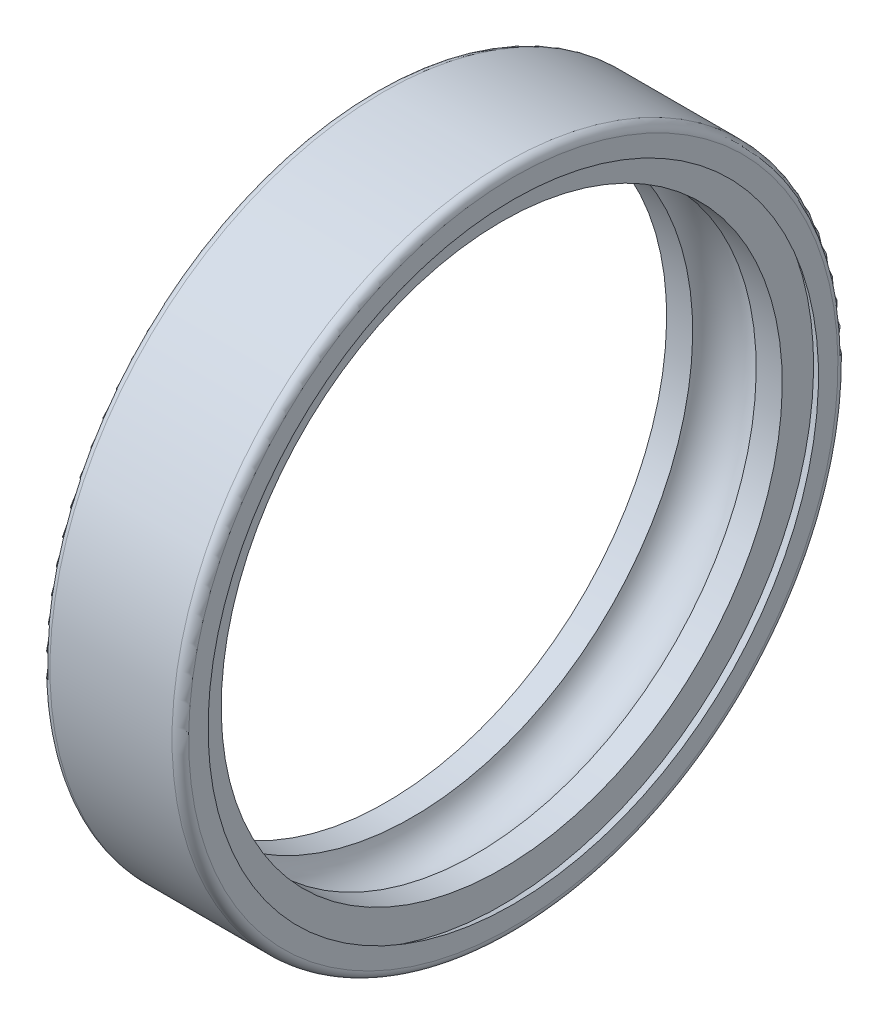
ISO-10303-21;
HEADER;
FILE_DESCRIPTION(('STEP AP214'),'2;1');
FILE_NAME('part.step','',(''),(''),'','','');
FILE_SCHEMA(('AUTOMOTIVE_DESIGN { 1 0 10303 214 1 1 1 1 }'));
ENDSEC;
DATA;
#1=APPLICATION_CONTEXT('core data for automotive mechanical design processes');
#2=APPLICATION_PROTOCOL_DEFINITION('international standard','automotive_design',2000,#1);
#3=PRODUCT_CONTEXT('',#1,'mechanical');
#4=PRODUCT('Part','Part','',(#3));
#5=PRODUCT_RELATED_PRODUCT_CATEGORY('part','',(#4));
#6=PRODUCT_DEFINITION_FORMATION('','',#4);
#7=PRODUCT_DEFINITION_CONTEXT('part definition',#1,'design');
#8=PRODUCT_DEFINITION('design','',#6,#7);
#9=PRODUCT_DEFINITION_SHAPE('','',#8);
#10=(LENGTH_UNIT() NAMED_UNIT(*) SI_UNIT(.MILLI.,.METRE.));
#11=(NAMED_UNIT(*) PLANE_ANGLE_UNIT() SI_UNIT($,.RADIAN.));
#12=(NAMED_UNIT(*) SI_UNIT($,.STERADIAN.) SOLID_ANGLE_UNIT());
#13=UNCERTAINTY_MEASURE_WITH_UNIT(LENGTH_MEASURE(1.E-05),#10,'distance_accuracy_value','');
#14=(GEOMETRIC_REPRESENTATION_CONTEXT(3) GLOBAL_UNCERTAINTY_ASSIGNED_CONTEXT((#13)) GLOBAL_UNIT_ASSIGNED_CONTEXT((#10,
#11,#12)) REPRESENTATION_CONTEXT('',''));
#15=CARTESIAN_POINT('',(0.,0.,0.));
#16=DIRECTION('',(0.,0.,1.));
#17=DIRECTION('',(1.,0.,0.));
#18=AXIS2_PLACEMENT_3D('',#15,#16,#17);
#19=CARTESIAN_POINT('',(4.58333333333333,10.6752813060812,0.));
#20=DIRECTION('',(1.,0.,0.));
#21=DIRECTION('',(0.,1.,0.));
#22=AXIS2_PLACEMENT_3D('',#19,#20,#21);
#23=PLANE('',#22);
#24=CARTESIAN_POINT('',(4.58333333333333,0.,0.));
#25=DIRECTION('',(1.,0.,0.));
#26=DIRECTION('',(0.,1.,0.));
#27=AXIS2_PLACEMENT_3D('',#24,#25,#26);
#28=CIRCLE('',#27,11.2405626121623);
#29=CARTESIAN_POINT('',(4.58333333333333,11.2405626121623,0.));
#30=VERTEX_POINT('',#29);
#31=EDGE_CURVE('E11',#30,#30,#28,.T.);
#32=ORIENTED_EDGE('',*,*,#31,.T.);
#33=EDGE_LOOP('',(#32));
#34=FACE_BOUND('',#33,.T.);
#35=CARTESIAN_POINT('',(4.58333333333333,0.,0.));
#36=DIRECTION('',(1.,0.,0.));
#37=DIRECTION('',(0.,1.,0.));
#38=AXIS2_PLACEMENT_3D('',#35,#36,#37);
#39=CIRCLE('',#38,10.11);
#40=CARTESIAN_POINT('',(4.58333333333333,10.11,0.));
#41=VERTEX_POINT('',#40);
#42=EDGE_CURVE('E73',#41,#41,#39,.T.);
#43=ORIENTED_EDGE('',*,*,#42,.F.);
#44=EDGE_LOOP('',(#43));
#45=FACE_BOUND('',#44,.T.);
#46=ADVANCED_FACE('F17',(#34,#45),#23,.T.);
#47=CARTESIAN_POINT('',(4.79166666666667,0.,0.));
#48=DIRECTION('',(-1.,0.,0.));
#49=DIRECTION('',(0.,1.,0.));
#50=AXIS2_PLACEMENT_3D('',#47,#48,#49);
#51=CONICAL_SURFACE('',#50,11.1202813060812,0.523598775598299);
#52=CARTESIAN_POINT('',(5.,0.,0.));
#53=DIRECTION('',(1.,0.,0.));
#54=DIRECTION('',(0.,1.,0.));
#55=AXIS2_PLACEMENT_3D('',#52,#53,#54);
#56=CIRCLE('',#55,11.);
#57=CARTESIAN_POINT('',(5.,11.,0.));
#58=VERTEX_POINT('',#57);
#59=EDGE_CURVE('E27',#58,#58,#56,.T.);
#60=ORIENTED_EDGE('',*,*,#59,.T.);
#61=EDGE_LOOP('',(#60));
#62=FACE_BOUND('',#61,.T.);
#63=ORIENTED_EDGE('',*,*,#31,.F.);
#64=EDGE_LOOP('',(#63));
#65=FACE_BOUND('',#64,.T.);
#66=ADVANCED_FACE('F106',(#62,#65),#51,.F.);
#67=CARTESIAN_POINT('',(5.,11.35,0.));
#68=DIRECTION('',(1.,0.,0.));
#69=DIRECTION('',(0.,1.,0.));
#70=AXIS2_PLACEMENT_3D('',#67,#68,#69);
#71=PLANE('',#70);
#72=CARTESIAN_POINT('',(5.,0.,0.));
#73=DIRECTION('',(1.,0.,0.));
#74=DIRECTION('',(0.,1.,0.));
#75=AXIS2_PLACEMENT_3D('',#72,#73,#74);
#76=CIRCLE('',#75,11.7);
#77=CARTESIAN_POINT('',(5.,11.7,0.));
#78=VERTEX_POINT('',#77);
#79=EDGE_CURVE('E83',#78,#78,#76,.T.);
#80=ORIENTED_EDGE('',*,*,#79,.T.);
#81=EDGE_LOOP('',(#80));
#82=FACE_BOUND('',#81,.T.);
#83=ORIENTED_EDGE('',*,*,#59,.F.);
#84=EDGE_LOOP('',(#83));
#85=FACE_BOUND('',#84,.T.);
#86=ADVANCED_FACE('F111',(#82,#85),#71,.T.);
#87=CARTESIAN_POINT('',(4.7,0.,0.));
#88=DIRECTION('',(1.,0.,0.));
#89=DIRECTION('',(0.,0.,-1.));
#90=AXIS2_PLACEMENT_3D('',#87,#88,#89);
#91=TOROIDAL_SURFACE('',#90,11.7,0.3);
#92=CARTESIAN_POINT('',(4.7,0.,0.));
#93=DIRECTION('',(1.,0.,0.));
#94=DIRECTION('',(0.,1.,0.));
#95=AXIS2_PLACEMENT_3D('',#92,#93,#94);
#96=CIRCLE('',#95,12.);
#97=CARTESIAN_POINT('',(4.7,12.,0.));
#98=VERTEX_POINT('',#97);
#99=EDGE_CURVE('E82',#98,#98,#96,.T.);
#100=ORIENTED_EDGE('',*,*,#99,.T.);
#101=EDGE_LOOP('',(#100));
#102=FACE_BOUND('',#101,.T.);
#103=ORIENTED_EDGE('',*,*,#79,.F.);
#104=EDGE_LOOP('',(#103));
#105=FACE_BOUND('',#104,.T.);
#106=ADVANCED_FACE('F102',(#102,#105),#91,.T.);
#107=CARTESIAN_POINT('',(2.5,0.,0.));
#108=DIRECTION('',(-1.,0.,0.));
#109=DIRECTION('',(0.,1.,0.));
#110=AXIS2_PLACEMENT_3D('',#107,#108,#109);
#111=CYLINDRICAL_SURFACE('',#110,12.);
#112=CARTESIAN_POINT('',(0.3,0.,0.));
#113=DIRECTION('',(1.,0.,0.));
#114=DIRECTION('',(0.,1.,0.));
#115=AXIS2_PLACEMENT_3D('',#112,#113,#114);
#116=CIRCLE('',#115,12.);
#117=CARTESIAN_POINT('',(0.3,12.,0.));
#118=VERTEX_POINT('',#117);
#119=EDGE_CURVE('E21',#118,#118,#116,.T.);
#120=ORIENTED_EDGE('',*,*,#119,.T.);
#121=EDGE_LOOP('',(#120));
#122=FACE_BOUND('',#121,.T.);
#123=ORIENTED_EDGE('',*,*,#99,.F.);
#124=EDGE_LOOP('',(#123));
#125=FACE_BOUND('',#124,.T.);
#126=ADVANCED_FACE('F88',(#122,#125),#111,.T.);
#127=CARTESIAN_POINT('',(0.3,0.,0.));
#128=DIRECTION('',(1.,0.,0.));
#129=DIRECTION('',(0.,0.,-1.));
#130=AXIS2_PLACEMENT_3D('',#127,#128,#129);
#131=TOROIDAL_SURFACE('',#130,11.7,0.3);
#132=CARTESIAN_POINT('',(0.,0.,0.));
#133=DIRECTION('',(1.,0.,0.));
#134=DIRECTION('',(0.,1.,0.));
#135=AXIS2_PLACEMENT_3D('',#132,#133,#134);
#136=CIRCLE('',#135,11.7);
#137=CARTESIAN_POINT('',(0.,11.7,0.));
#138=VERTEX_POINT('',#137);
#139=EDGE_CURVE('E80',#138,#138,#136,.T.);
#140=ORIENTED_EDGE('',*,*,#139,.T.);
#141=EDGE_LOOP('',(#140));
#142=FACE_BOUND('',#141,.T.);
#143=ORIENTED_EDGE('',*,*,#119,.F.);
#144=EDGE_LOOP('',(#143));
#145=FACE_BOUND('',#144,.T.);
#146=ADVANCED_FACE('F91',(#142,#145),#131,.T.);
#147=CARTESIAN_POINT('',(0.,11.35,0.));
#148=DIRECTION('',(-1.,0.,0.));
#149=DIRECTION('',(0.,-1.,0.));
#150=AXIS2_PLACEMENT_3D('',#147,#148,#149);
#151=PLANE('',#150);
#152=CARTESIAN_POINT('',(0.,0.,0.));
#153=DIRECTION('',(1.,0.,0.));
#154=DIRECTION('',(0.,1.,0.));
#155=AXIS2_PLACEMENT_3D('',#152,#153,#154);
#156=CIRCLE('',#155,11.);
#157=CARTESIAN_POINT('',(0.,11.,0.));
#158=VERTEX_POINT('',#157);
#159=EDGE_CURVE('E71',#158,#158,#156,.T.);
#160=ORIENTED_EDGE('',*,*,#159,.T.);
#161=EDGE_LOOP('',(#160));
#162=FACE_BOUND('',#161,.T.);
#163=ORIENTED_EDGE('',*,*,#139,.F.);
#164=EDGE_LOOP('',(#163));
#165=FACE_BOUND('',#164,.T.);
#166=ADVANCED_FACE('F93',(#162,#165),#151,.T.);
#167=CARTESIAN_POINT('',(0.208333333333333,0.,0.));
#168=DIRECTION('',(1.,0.,0.));
#169=DIRECTION('',(0.,1.,0.));
#170=AXIS2_PLACEMENT_3D('',#167,#168,#169);
#171=CONICAL_SURFACE('',#170,11.1202813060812,0.523598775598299);
#172=CARTESIAN_POINT('',(0.416666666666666,0.,0.));
#173=DIRECTION('',(1.,0.,0.));
#174=DIRECTION('',(0.,1.,0.));
#175=AXIS2_PLACEMENT_3D('',#172,#173,#174);
#176=CIRCLE('',#175,11.2405626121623);
#177=CARTESIAN_POINT('',(0.416666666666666,11.2405626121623,0.));
#178=VERTEX_POINT('',#177);
#179=EDGE_CURVE('E68',#178,#178,#176,.T.);
#180=ORIENTED_EDGE('',*,*,#179,.T.);
#181=EDGE_LOOP('',(#180));
#182=FACE_BOUND('',#181,.T.);
#183=ORIENTED_EDGE('',*,*,#159,.F.);
#184=EDGE_LOOP('',(#183));
#185=FACE_BOUND('',#184,.T.);
#186=ADVANCED_FACE('F19',(#182,#185),#171,.F.);
#187=CARTESIAN_POINT('',(0.416666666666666,10.6752813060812,0.));
#188=DIRECTION('',(-1.,0.,0.));
#189=DIRECTION('',(0.,-1.,0.));
#190=AXIS2_PLACEMENT_3D('',#187,#188,#189);
#191=PLANE('',#190);
#192=CARTESIAN_POINT('',(0.416666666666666,0.,0.));
#193=DIRECTION('',(1.,0.,0.));
#194=DIRECTION('',(0.,1.,0.));
#195=AXIS2_PLACEMENT_3D('',#192,#193,#194);
#196=CIRCLE('',#195,10.11);
#197=CARTESIAN_POINT('',(0.416666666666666,10.11,0.));
#198=VERTEX_POINT('',#197);
#199=EDGE_CURVE('E64',#198,#198,#196,.T.);
#200=ORIENTED_EDGE('',*,*,#199,.T.);
#201=EDGE_LOOP('',(#200));
#202=FACE_BOUND('',#201,.T.);
#203=ORIENTED_EDGE('',*,*,#179,.F.);
#204=EDGE_LOOP('',(#203));
#205=FACE_BOUND('',#204,.T.);
#206=ADVANCED_FACE('F65',(#202,#205),#191,.T.);
#207=CARTESIAN_POINT('',(0.885969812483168,0.,0.));
#208=DIRECTION('',(-1.,0.,0.));
#209=DIRECTION('',(0.,1.,0.));
#210=AXIS2_PLACEMENT_3D('',#207,#208,#209);
#211=CYLINDRICAL_SURFACE('',#210,10.11);
#212=CARTESIAN_POINT('',(1.35527295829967,0.,0.));
#213=DIRECTION('',(1.,0.,0.));
#214=DIRECTION('',(0.,1.,0.));
#215=AXIS2_PLACEMENT_3D('',#212,#213,#214);
#216=CIRCLE('',#215,10.11);
#217=CARTESIAN_POINT('',(1.35527295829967,10.11,0.));
#218=VERTEX_POINT('',#217);
#219=EDGE_CURVE('E69',#218,#218,#216,.T.);
#220=ORIENTED_EDGE('',*,*,#219,.T.);
#221=EDGE_LOOP('',(#220));
#222=FACE_BOUND('',#221,.T.);
#223=ORIENTED_EDGE('',*,*,#199,.F.);
#224=EDGE_LOOP('',(#223));
#225=FACE_BOUND('',#224,.T.);
#226=ADVANCED_FACE('F117',(#222,#225),#211,.F.);
#227=CARTESIAN_POINT('',(2.5,0.,0.));
#228=DIRECTION('',(1.,0.,0.));
#229=DIRECTION('',(0.,0.,-1.));
#230=AXIS2_PLACEMENT_3D('',#227,#228,#229);
#231=TOROIDAL_SURFACE('',#230,9.75,1.2);
#232=CARTESIAN_POINT('',(3.64472704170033,0.,0.));
#233=DIRECTION('',(1.,0.,0.));
#234=DIRECTION('',(0.,1.,0.));
#235=AXIS2_PLACEMENT_3D('',#232,#233,#234);
#236=CIRCLE('',#235,10.11);
#237=CARTESIAN_POINT('',(3.64472704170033,10.11,0.));
#238=VERTEX_POINT('',#237);
#239=EDGE_CURVE('E76',#238,#238,#236,.T.);
#240=ORIENTED_EDGE('',*,*,#239,.T.);
#241=EDGE_LOOP('',(#240));
#242=FACE_BOUND('',#241,.T.);
#243=ORIENTED_EDGE('',*,*,#219,.F.);
#244=EDGE_LOOP('',(#243));
#245=FACE_BOUND('',#244,.T.);
#246=ADVANCED_FACE('F177',(#242,#245),#231,.F.);
#247=CARTESIAN_POINT('',(4.11403018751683,0.,0.));
#248=DIRECTION('',(-1.,0.,0.));
#249=DIRECTION('',(0.,1.,0.));
#250=AXIS2_PLACEMENT_3D('',#247,#248,#249);
#251=CYLINDRICAL_SURFACE('',#250,10.11);
#252=ORIENTED_EDGE('',*,*,#42,.T.);
#253=EDGE_LOOP('',(#252));
#254=FACE_BOUND('',#253,.T.);
#255=ORIENTED_EDGE('',*,*,#239,.F.);
#256=EDGE_LOOP('',(#255));
#257=FACE_BOUND('',#256,.T.);
#258=ADVANCED_FACE('F186',(#254,#257),#251,.F.);
#259=CLOSED_SHELL('',(#46,#66,#86,#106,#126,#146,#166,#186,#206,#226,#246,#258));
#260=MANIFOLD_SOLID_BREP('B1',#259);
#261=ADVANCED_BREP_SHAPE_REPRESENTATION('',(#18,#260),#14);
#262=SHAPE_DEFINITION_REPRESENTATION(#9,#261);
ENDSEC;
END-ISO-10303-21;
